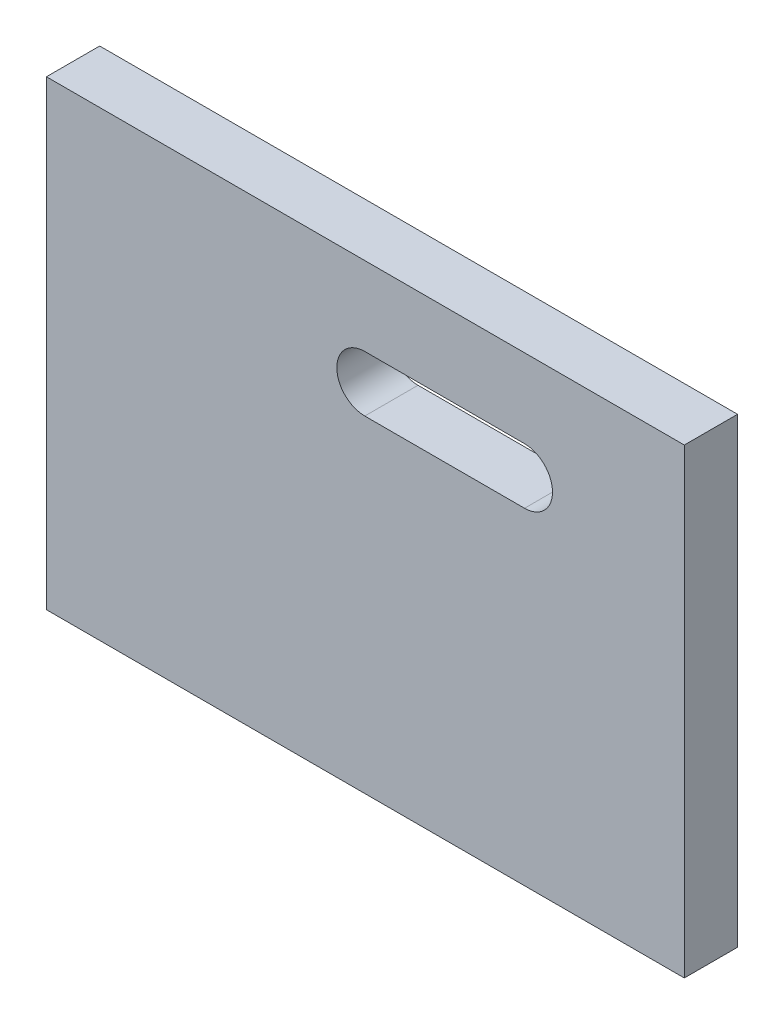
from build123d import *

# Parameters (mm, degrees)
SKIZZE1_W               = 119.773967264
SKIZZE1_H               = 86.672798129
LINEAR_AUSTRAGEN1_DEPTH = 10


with BuildPart() as part:
    # Skizze1 → Linear austragen1 (new body)
    with BuildSketch(Plane.XY):
        with Locations((-11.755494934, 2.360813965)):
            Rectangle(SKIZZE1_W, SKIZZE1_H)
        with BuildLine():
            Line((18.131488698, 30.912294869), (-11.868511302, 30.912294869))
            ThreePointArc((-11.868511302, 30.912294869), (-17.118511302, 25.662294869), (-11.868511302, 20.412294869))
            Line((-11.868511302, 20.412294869), (18.131488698, 20.412294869))
            ThreePointArc((18.131488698, 20.412294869), (23.381488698, 25.662294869), (18.131488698, 30.912294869))
        make_face(mode=Mode.SUBTRACT)
    extrude(amount=LINEAR_AUSTRAGEN1_DEPTH)


solid = part.part
